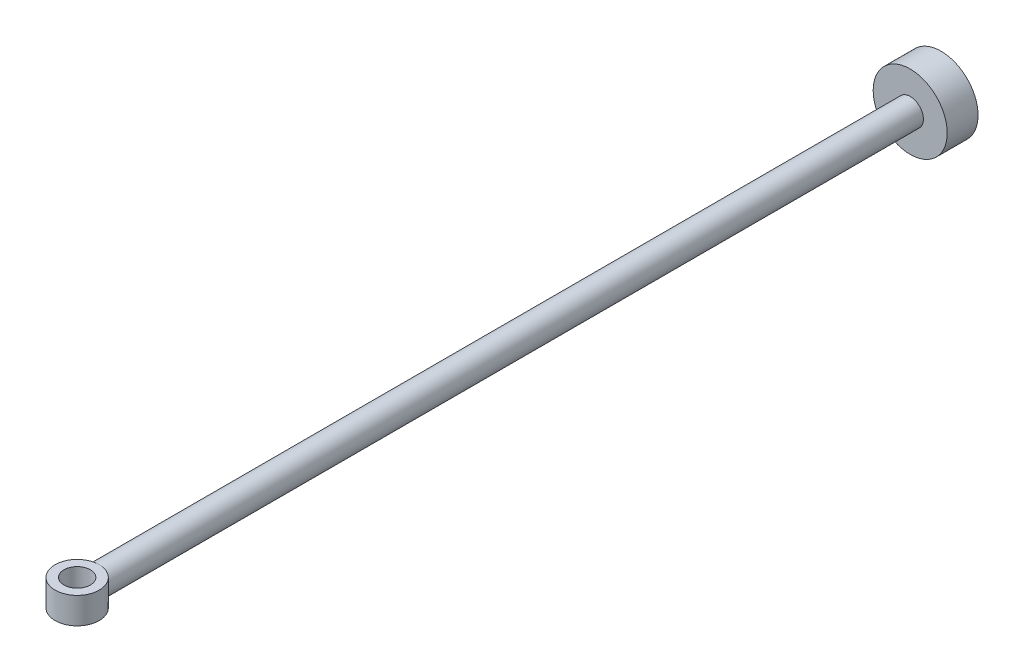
ISO-10303-21;
HEADER;
FILE_DESCRIPTION(('STEP AP214'),'2;1');
FILE_NAME('part.step','',(''),(''),'','','');
FILE_SCHEMA(('AUTOMOTIVE_DESIGN { 1 0 10303 214 1 1 1 1 }'));
ENDSEC;
DATA;
#1=APPLICATION_CONTEXT('core data for automotive mechanical design processes');
#2=APPLICATION_PROTOCOL_DEFINITION('international standard','automotive_design',2000,#1);
#3=PRODUCT_CONTEXT('',#1,'mechanical');
#4=PRODUCT('Part','Part','',(#3));
#5=PRODUCT_RELATED_PRODUCT_CATEGORY('part','',(#4));
#6=PRODUCT_DEFINITION_FORMATION('','',#4);
#7=PRODUCT_DEFINITION_CONTEXT('part definition',#1,'design');
#8=PRODUCT_DEFINITION('design','',#6,#7);
#9=PRODUCT_DEFINITION_SHAPE('','',#8);
#10=(LENGTH_UNIT() NAMED_UNIT(*) SI_UNIT(.MILLI.,.METRE.));
#11=(NAMED_UNIT(*) PLANE_ANGLE_UNIT() SI_UNIT($,.RADIAN.));
#12=(NAMED_UNIT(*) SI_UNIT($,.STERADIAN.) SOLID_ANGLE_UNIT());
#13=UNCERTAINTY_MEASURE_WITH_UNIT(LENGTH_MEASURE(1.E-05),#10,'distance_accuracy_value','');
#14=(GEOMETRIC_REPRESENTATION_CONTEXT(3) GLOBAL_UNCERTAINTY_ASSIGNED_CONTEXT((#13)) GLOBAL_UNIT_ASSIGNED_CONTEXT((#10,
#11,#12)) REPRESENTATION_CONTEXT('',''));
#15=CARTESIAN_POINT('',(0.,0.,0.));
#16=DIRECTION('',(0.,0.,1.));
#17=DIRECTION('',(1.,0.,0.));
#18=AXIS2_PLACEMENT_3D('',#15,#16,#17);
#19=CARTESIAN_POINT('',(0.,0.,925.));
#20=DIRECTION('',(0.,0.,-1.));
#21=DIRECTION('',(-1.,0.,0.));
#22=AXIS2_PLACEMENT_3D('',#19,#20,#21);
#23=CYLINDRICAL_SURFACE('',#22,15.);
#24=CARTESIAN_POINT('',(0.,0.,0.));
#25=DIRECTION('',(0.,0.,-1.));
#26=DIRECTION('',(-1.,0.,0.));
#27=AXIS2_PLACEMENT_3D('',#24,#25,#26);
#28=CIRCLE('',#27,15.);
#29=CARTESIAN_POINT('',(-15.,0.,0.));
#30=VERTEX_POINT('',#29);
#31=EDGE_CURVE('E11',#30,#30,#28,.T.);
#32=ORIENTED_EDGE('',*,*,#31,.F.);
#33=EDGE_LOOP('',(#32));
#34=FACE_BOUND('',#33,.T.);
#35=CARTESIAN_POINT('',(0.,-15.,920.));
#36=CARTESIAN_POINT('',(0.192860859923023,-15.0000014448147,919.999997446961));
#37=CARTESIAN_POINT('',(0.385694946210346,-14.9962796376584,920.002232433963));
#38=CARTESIAN_POINT('',(0.770964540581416,-14.9814143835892,920.011147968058));
#39=CARTESIAN_POINT('',(0.963400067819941,-14.9702713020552,920.017828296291));
#40=CARTESIAN_POINT('',(1.53933864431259,-14.9257686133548,920.044480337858));
#41=CARTESIAN_POINT('',(1.92175698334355,-14.8813354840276,920.071063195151));
#42=CARTESIAN_POINT('',(2.6783661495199,-14.7638811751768,920.140997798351));
#43=CARTESIAN_POINT('',(3.05259072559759,-14.6910190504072,920.184256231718));
#44=CARTESIAN_POINT('',(3.79241058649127,-14.5176433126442,920.28650031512));
#45=CARTESIAN_POINT('',(4.15800515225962,-14.4171274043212,920.345487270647));
#46=CARTESIAN_POINT('',(4.87752729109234,-14.1898499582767,920.477697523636));
#47=CARTESIAN_POINT('',(5.23147447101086,-14.0631354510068,920.550895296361));
#48=CARTESIAN_POINT('',(5.9264462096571,-13.7846796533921,920.70999508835));
#49=CARTESIAN_POINT('',(6.26746941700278,-13.6329357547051,920.795898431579));
#50=CARTESIAN_POINT('',(6.93525859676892,-13.3056605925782,920.978714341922));
#51=CARTESIAN_POINT('',(7.26200977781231,-13.130105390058,921.075637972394));
#52=CARTESIAN_POINT('',(7.89956440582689,-12.7566995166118,921.278515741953));
#53=CARTESIAN_POINT('',(8.21036714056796,-12.5588478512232,921.384470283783));
#54=CARTESIAN_POINT('',(8.83778736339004,-12.1263946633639,921.61168926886));
#55=CARTESIAN_POINT('',(9.15306964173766,-11.8901459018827,921.733505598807));
#56=CARTESIAN_POINT('',(9.76291888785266,-11.3947285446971,921.982745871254));
#57=CARTESIAN_POINT('',(10.0574771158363,-11.1355503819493,922.110172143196));
#58=CARTESIAN_POINT('',(10.6250045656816,-10.5954171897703,922.368020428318));
#59=CARTESIAN_POINT('',(10.8979553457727,-10.3144439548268,922.498444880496));
#60=CARTESIAN_POINT('',(11.4210525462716,-9.73204917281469,922.759383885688));
#61=CARTESIAN_POINT('',(11.671198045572,-9.4306268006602,922.889898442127));
#62=CARTESIAN_POINT('',(12.176992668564,-8.7700907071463,923.16394242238));
#63=CARTESIAN_POINT('',(12.4295410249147,-8.40843919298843,923.307100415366));
#64=CARTESIAN_POINT('',(12.9030768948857,-7.66198299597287,923.585377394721));
#65=CARTESIAN_POINT('',(13.1240591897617,-7.27717449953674,923.720495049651));
#66=CARTESIAN_POINT('',(13.5322686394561,-6.48655272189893,923.977729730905));
#67=CARTESIAN_POINT('',(13.719540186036,-6.08076798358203,924.099863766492));
#68=CARTESIAN_POINT('',(14.0584569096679,-5.24984883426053,924.326311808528));
#69=CARTESIAN_POINT('',(14.2101153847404,-4.82472171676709,924.430632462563));
#70=CARTESIAN_POINT('',(14.443429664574,-4.06270218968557,924.594059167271));
#71=CARTESIAN_POINT('',(14.5331460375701,-3.72929594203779,924.65800030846));
#72=CARTESIAN_POINT('',(14.6897491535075,-3.05468494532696,924.770798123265));
#73=CARTESIAN_POINT('',(14.7566409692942,-2.71348194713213,924.819658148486));
#74=CARTESIAN_POINT('',(14.8666727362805,-2.0256408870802,924.900579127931));
#75=CARTESIAN_POINT('',(14.9098367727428,-1.67900870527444,924.932657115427));
#76=CARTESIAN_POINT('',(14.9718813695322,-0.982367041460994,924.978904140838));
#77=CARTESIAN_POINT('',(14.9907615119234,-0.632357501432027,924.993072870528));
#78=CARTESIAN_POINT('',(15.00394994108,0.069076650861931,925.002961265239));
#79=CARTESIAN_POINT('',(14.9982098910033,0.420502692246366,924.998644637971));
#80=CARTESIAN_POINT('',(14.9621409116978,1.12137271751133,924.97164914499));
#81=CARTESIAN_POINT('',(14.9318118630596,1.47081669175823,924.948970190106));
#82=CARTESIAN_POINT('',(14.8470080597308,2.16537418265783,924.886096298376));
#83=CARTESIAN_POINT('',(14.7925178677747,2.51048478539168,924.845890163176));
#84=CARTESIAN_POINT('',(14.6601586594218,3.19388594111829,924.749409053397));
#85=CARTESIAN_POINT('',(14.5822891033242,3.53217633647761,924.693133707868));
#86=CARTESIAN_POINT('',(14.4053151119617,4.19561909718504,924.567219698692));
#87=CARTESIAN_POINT('',(14.3065055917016,4.52088612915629,924.49776790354));
#88=CARTESIAN_POINT('',(14.0880230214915,5.16161070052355,924.347028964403));
#89=CARTESIAN_POINT('',(13.9683431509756,5.4770649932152,924.265737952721));
#90=CARTESIAN_POINT('',(13.7091201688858,6.096958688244,924.093440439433));
#91=CARTESIAN_POINT('',(13.5695760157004,6.40139751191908,924.002433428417));
#92=CARTESIAN_POINT('',(13.2715462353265,6.99838443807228,923.812804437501));
#93=CARTESIAN_POINT('',(13.1130596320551,7.29093192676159,923.714182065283));
#94=CARTESIAN_POINT('',(12.7486309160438,7.91355198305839,923.49359749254));
#95=CARTESIAN_POINT('',(12.5392377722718,8.24123192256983,923.370571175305));
#96=CARTESIAN_POINT('',(12.0966533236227,8.87813926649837,923.119971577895));
#97=CARTESIAN_POINT('',(11.8634657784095,9.18736957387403,922.992399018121));
#98=CARTESIAN_POINT('',(11.3740114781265,9.78681422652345,922.735491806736));
#99=CARTESIAN_POINT('',(11.1177207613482,10.0770082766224,922.606155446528));
#100=CARTESIAN_POINT('',(10.5831976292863,10.6370000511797,922.348643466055));
#101=CARTESIAN_POINT('',(10.3049641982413,10.9067968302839,922.220467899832));
#102=CARTESIAN_POINT('',(9.68709201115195,11.4610510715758,921.950287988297));
#103=CARTESIAN_POINT('',(9.34430498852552,11.7422911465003,921.808853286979));
#104=CARTESIAN_POINT('',(8.63283493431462,12.2748369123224,921.534716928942));
#105=CARTESIAN_POINT('',(8.264148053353,12.5261381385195,921.40201657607));
#106=CARTESIAN_POINT('',(7.50293001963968,12.9963862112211,921.149071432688));
#107=CARTESIAN_POINT('',(7.11041316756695,13.215352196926,921.028819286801));
#108=CARTESIAN_POINT('',(6.30369026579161,13.6186156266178,920.804160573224));
#109=CARTESIAN_POINT('',(5.88949084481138,13.8029235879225,920.699749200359));
#110=CARTESIAN_POINT('',(5.12444851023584,14.1022888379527,920.52833091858));
#111=CARTESIAN_POINT('',(4.77687988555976,14.2238446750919,920.457996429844));
#112=CARTESIAN_POINT('',(4.07144379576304,14.4415904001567,920.331159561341));
#113=CARTESIAN_POINT('',(3.71357812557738,14.5377846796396,920.274654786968));
#114=CARTESIAN_POINT('',(2.99046346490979,14.7035529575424,920.176825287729));
#115=CARTESIAN_POINT('',(2.62523067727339,14.7731798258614,920.135470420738));
#116=CARTESIAN_POINT('',(1.88930637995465,14.8851909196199,920.068757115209));
#117=CARTESIAN_POINT('',(1.51861794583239,14.9275899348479,920.043389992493));
#118=CARTESIAN_POINT('',(0.955880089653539,14.9707353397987,920.017550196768));
#119=CARTESIAN_POINT('',(0.764828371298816,14.9817109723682,920.010970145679));
#120=CARTESIAN_POINT('',(0.382525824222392,14.9963406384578,920.002195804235));
#121=CARTESIAN_POINT('',(0.191275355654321,15.0000015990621,919.999997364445));
#122=CARTESIAN_POINT('',(0.,15.,920.));
#123=B_SPLINE_CURVE_WITH_KNOTS('',3,(#35,#36,#37,#38,#39,#40,#41,#42,#43,#44,#45,#46,#47,#48,
#49,#50,#51,#52,#53,#54,#55,#56,#57,#58,#59,#60,#61,#62,#63,#64,#65,#66,#67,#68,#69,#70,#71,#72,
#73,#74,#75,#76,#77,#78,#79,#80,#81,#82,#83,#84,#85,#86,#87,#88,#89,#90,#91,#92,#93,#94,#95,#96,
#97,#98,#99,#100,#101,#102,#103,#104,#105,#106,#107,#108,#109,#110,#111,#112,#113,#114,#115,
#116,#117,#118,#119,#120,#121,#122),.UNSPECIFIED.,.F.,.F.,(4,2,2,2,2,2,2,2,2,2,2,2,2,2,2,2,2,2,
2,2,2,2,2,2,2,2,2,2,2,2,2,2,2,2,2,2,2,2,2,2,2,2,2,4),(0.,0.578480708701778,1.15693293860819,
2.31299060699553,3.46267101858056,4.61244688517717,5.76017637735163,6.90802555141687,
8.057037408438,9.20610053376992,10.4419897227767,11.6783970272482,12.9158484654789,
14.1533498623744,15.5429150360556,16.9327096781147,18.3206605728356,19.7080923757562,
20.7604537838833,21.8125811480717,22.8636385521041,23.9147140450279,24.9678540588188,
26.0209991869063,27.0748181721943,28.1286614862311,29.1685467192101,30.2087724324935,
31.2490527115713,32.2893866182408,33.5117829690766,34.733986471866,35.9574725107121,
37.1810152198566,38.5754889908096,39.9701704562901,41.364023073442,42.7574520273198,
43.8808904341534,45.004134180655,46.1251308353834,47.2455180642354,47.8197913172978,
48.3935204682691),.UNSPECIFIED.);
#124=CARTESIAN_POINT('',(0.,-15.,920.));
#125=VERTEX_POINT('',#124);
#126=CARTESIAN_POINT('',(0.,15.,920.));
#127=VERTEX_POINT('',#126);
#128=EDGE_CURVE('E49',#125,#127,#123,.T.);
#129=ORIENTED_EDGE('',*,*,#128,.F.);
#130=CARTESIAN_POINT('',(0.,15.,920.));
#131=CARTESIAN_POINT('',(-0.192860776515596,15.0000014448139,919.999997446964));
#132=CARTESIAN_POINT('',(-0.385694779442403,14.9962796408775,920.00223243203));
#133=CARTESIAN_POINT('',(-0.770964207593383,14.9814143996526,920.011147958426));
#134=CARTESIAN_POINT('',(-0.963399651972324,14.9702713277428,920.017828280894));
#135=CARTESIAN_POINT('',(-1.53933798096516,14.9257686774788,920.044480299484));
#136=CARTESIAN_POINT('',(-1.92175615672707,14.8813355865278,920.071063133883));
#137=CARTESIAN_POINT('',(-2.67836533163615,14.7638813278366,920.140997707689));
#138=CARTESIAN_POINT('',(-3.05259007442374,14.6910191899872,920.184256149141));
#139=CARTESIAN_POINT('',(-3.79241026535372,14.5176434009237,920.286500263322));
#140=CARTESIAN_POINT('',(-4.15800499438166,14.4171274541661,920.345487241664));
#141=CARTESIAN_POINT('',(-4.87752609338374,14.1898503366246,920.477697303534));
#142=CARTESIAN_POINT('',(-5.23147211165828,14.0631362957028,920.550894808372));
#143=CARTESIAN_POINT('',(-5.92644161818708,13.7846815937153,920.709993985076));
#144=CARTESIAN_POINT('',(-6.26746375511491,13.632938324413,920.795896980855));
#145=CARTESIAN_POINT('',(-6.93525309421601,13.3056634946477,920.978712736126));
#146=CARTESIAN_POINT('',(-7.262005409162,13.1301078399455,921.075636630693));
#147=CARTESIAN_POINT('',(-7.89956227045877,12.7567008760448,921.278515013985));
#148=CARTESIAN_POINT('',(-8.21036610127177,12.5588485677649,921.384469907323));
#149=CARTESIAN_POINT('',(-8.83779425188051,12.1263899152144,921.6116917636));
#150=CARTESIAN_POINT('',(-9.15308300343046,11.8901358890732,921.733510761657));
#151=CARTESIAN_POINT('',(-9.76294440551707,11.3947069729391,921.982756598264));
#152=CARTESIAN_POINT('',(-10.0575083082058,11.1355225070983,922.11018576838));
#153=CARTESIAN_POINT('',(-10.6250339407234,10.5953874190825,922.368034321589));
#154=CARTESIAN_POINT('',(-10.8979781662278,10.3144195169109,922.498456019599));
#155=CARTESIAN_POINT('',(-11.421063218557,9.7320363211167,922.759389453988));
#156=CARTESIAN_POINT('',(-11.671203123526,9.43062020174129,922.889901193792));
#157=CARTESIAN_POINT('',(-12.1769603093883,8.7701329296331,923.163924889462));
#158=CARTESIAN_POINT('',(-12.4294799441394,8.40852651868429,923.30706578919));
#159=CARTESIAN_POINT('',(-12.9029623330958,7.66217254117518,923.585308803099));
#160=CARTESIAN_POINT('',(-13.1239203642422,7.2774215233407,923.720409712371));
#161=CARTESIAN_POINT('',(-13.5321392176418,6.48682519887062,923.977646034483));
#162=CARTESIAN_POINT('',(-13.7194366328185,6.08100342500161,924.099795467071));
#163=CARTESIAN_POINT('',(-14.0584072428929,5.24998901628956,924.326277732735));
#164=CARTESIAN_POINT('',(-14.2100914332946,4.82480240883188,924.430616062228));
#165=CARTESIAN_POINT('',(-14.4501766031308,4.04066425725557,924.598784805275));
#166=CARTESIAN_POINT('',(-14.5451300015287,3.68455366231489,924.666545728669));
#167=CARTESIAN_POINT('',(-14.7089736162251,2.96356047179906,924.784749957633));
#168=CARTESIAN_POINT('',(-14.7778675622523,2.59867913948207,924.835195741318));
#169=CARTESIAN_POINT('',(-14.8884829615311,1.86311947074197,924.916727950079));
#170=CARTESIAN_POINT('',(-14.9302375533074,1.49244877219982,924.947837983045));
#171=CARTESIAN_POINT('',(-14.9859963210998,0.74785271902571,924.989474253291));
#172=CARTESIAN_POINT('',(-15.0000001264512,0.373927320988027,925.000000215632));
#173=CARTESIAN_POINT('',(-14.9999998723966,-0.377334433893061,924.999999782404));
#174=CARTESIAN_POINT('',(-14.9857394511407,-0.754670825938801,924.989280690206));
#175=CARTESIAN_POINT('',(-14.9289611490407,-1.50601225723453,924.946886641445));
#176=CARTESIAN_POINT('',(-14.8864426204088,-1.88001721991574,924.91521120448));
#177=CARTESIAN_POINT('',(-14.7738334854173,-2.62198472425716,924.832235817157));
#178=CARTESIAN_POINT('',(-14.7037160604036,-2.98994102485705,924.780916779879));
#179=CARTESIAN_POINT('',(-14.5369932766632,-3.71684042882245,924.660718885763));
#180=CARTESIAN_POINT('',(-14.4403870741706,-4.07578324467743,924.591839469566));
#181=CARTESIAN_POINT('',(-14.2227797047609,-4.77988599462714,924.43960097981));
#182=CARTESIAN_POINT('',(-14.1019690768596,-5.12512980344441,924.356355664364));
#183=CARTESIAN_POINT('',(-13.8367175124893,-5.80326402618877,924.177636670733));
#184=CARTESIAN_POINT('',(-13.6922676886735,-6.13614973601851,924.082158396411));
#185=CARTESIAN_POINT('',(-13.3809615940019,-6.7882557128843,923.881663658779));
#186=CARTESIAN_POINT('',(-13.2141053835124,-7.107476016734,923.776647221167));
#187=CARTESIAN_POINT('',(-12.8590560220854,-7.73133304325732,923.559665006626));
#188=CARTESIAN_POINT('',(-12.6708621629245,-8.03596928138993,923.447698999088));
#189=CARTESIAN_POINT('',(-12.2497723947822,-8.66624267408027,923.205297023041));
#190=CARTESIAN_POINT('',(-12.0142244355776,-8.98988614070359,923.07427781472));
#191=CARTESIAN_POINT('',(-11.5186392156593,-9.616680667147,922.809916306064));
#192=CARTESIAN_POINT('',(-11.2586071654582,-9.91983606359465,922.676574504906));
#193=CARTESIAN_POINT('',(-10.7147783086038,-10.504911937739,922.410506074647));
#194=CARTESIAN_POINT('',(-10.4309597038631,-10.7868124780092,922.277780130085));
#195=CARTESIAN_POINT('',(-9.84076660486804,-11.3278232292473,922.016015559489));
#196=CARTESIAN_POINT('',(-9.53439110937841,-11.5869324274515,921.886977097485));
#197=CARTESIAN_POINT('',(-8.86558476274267,-12.107851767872,921.621709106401));
#198=CARTESIAN_POINT('',(-8.5006828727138,-12.3668831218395,921.486226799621));
#199=CARTESIAN_POINT('',(-7.74613530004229,-12.8529681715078,921.226979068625));
#200=CARTESIAN_POINT('',(-7.35648671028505,-13.0800181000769,921.10321502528));
#201=CARTESIAN_POINT('',(-6.55546683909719,-13.4992510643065,920.871192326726));
#202=CARTESIAN_POINT('',(-6.14414009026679,-13.6915022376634,920.762903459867));
#203=CARTESIAN_POINT('',(-5.30193153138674,-14.0391206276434,920.564851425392));
#204=CARTESIAN_POINT('',(-4.87105486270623,-14.1944974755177,920.475083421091));
#205=CARTESIAN_POINT('',(-4.07829184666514,-14.4396965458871,920.332268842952));
#206=CARTESIAN_POINT('',(-3.71918952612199,-14.5363859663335,920.275477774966));
#207=CARTESIAN_POINT('',(-2.99287256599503,-14.7031116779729,920.177088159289));
#208=CARTESIAN_POINT('',(-2.62565989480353,-14.7731543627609,920.13548596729));
#209=CARTESIAN_POINT('',(-1.88360670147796,-14.8860182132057,920.068263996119));
#210=CARTESIAN_POINT('',(-1.50873656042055,-14.928696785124,920.04272794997));
#211=CARTESIAN_POINT('',(-0.944227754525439,-14.9714438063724,920.017125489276));
#212=CARTESIAN_POINT('',(-0.755610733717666,-14.9821476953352,920.010708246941));
#213=CARTESIAN_POINT('',(-0.378004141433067,-14.9964266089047,920.002144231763));
#214=CARTESIAN_POINT('',(-0.189014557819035,-15.000001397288,919.999997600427));
#215=CARTESIAN_POINT('',(0.,-15.,920.));
#216=B_SPLINE_CURVE_WITH_KNOTS('',3,(#130,#131,#132,#133,#134,#135,#136,#137,#138,#139,#140,
#141,#142,#143,#144,#145,#146,#147,#148,#149,#150,#151,#152,#153,#154,#155,#156,#157,#158,#159,
#160,#161,#162,#163,#164,#165,#166,#167,#168,#169,#170,#171,#172,#173,#174,#175,#176,#177,#178,
#179,#180,#181,#182,#183,#184,#185,#186,#187,#188,#189,#190,#191,#192,#193,#194,#195,#196,#197,
#198,#199,#200,#201,#202,#203,#204,#205,#206,#207,#208,#209,#210,#211,#212,#213,#214,#215),
.UNSPECIFIED.,.F.,.F.,(4,2,2,2,2,2,2,2,2,2,2,2,2,2,2,2,2,2,2,2,2,2,2,2,2,2,2,2,2,2,2,2,2,2,2,2,
2,2,2,2,2,2,4),(0.,0.578480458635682,1.15693243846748,2.31298960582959,3.46267051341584,
4.61244688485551,5.76017255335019,6.90801789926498,8.05703346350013,9.20610053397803,
10.4420159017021,11.6784498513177,12.9158748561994,14.1533498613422,15.5427469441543,
16.932351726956,18.3204365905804,19.7080923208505,20.8309857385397,21.9537183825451,
23.0750775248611,24.1964516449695,25.3280433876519,26.4596610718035,27.5923811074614,
28.7251372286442,29.8493037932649,30.9738939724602,32.0984811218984,33.2231056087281,
34.485388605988,35.7474035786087,37.0105879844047,38.2738284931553,39.6746380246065,
41.0756124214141,42.4738132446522,43.8716484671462,44.998993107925,46.1260670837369,
47.2589674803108,47.8258969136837,48.3928451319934),.UNSPECIFIED.);
#217=EDGE_CURVE('E46',#127,#125,#216,.T.);
#218=ORIENTED_EDGE('',*,*,#217,.F.);
#219=EDGE_LOOP('',(#129,#218));
#220=FACE_BOUND('',#219,.T.);
#221=ADVANCED_FACE('F30',(#34,#220),#23,.T.);
#222=CARTESIAN_POINT('',(0.,0.,0.));
#223=DIRECTION('',(0.,0.,-1.));
#224=DIRECTION('',(-1.,0.,0.));
#225=AXIS2_PLACEMENT_3D('',#222,#223,#224);
#226=PLANE('',#225);
#227=CARTESIAN_POINT('',(0.,0.,0.));
#228=DIRECTION('',(0.,0.,-1.));
#229=DIRECTION('',(-1.,0.,0.));
#230=AXIS2_PLACEMENT_3D('',#227,#228,#229);
#231=CIRCLE('',#230,42.);
#232=CARTESIAN_POINT('',(-42.,0.,0.));
#233=VERTEX_POINT('',#232);
#234=EDGE_CURVE('E57',#233,#233,#231,.T.);
#235=ORIENTED_EDGE('',*,*,#234,.F.);
#236=EDGE_LOOP('',(#235));
#237=FACE_BOUND('',#236,.T.);
#238=ORIENTED_EDGE('',*,*,#31,.T.);
#239=EDGE_LOOP('',(#238));
#240=FACE_BOUND('',#239,.T.);
#241=ADVANCED_FACE('F85',(#237,#240),#226,.F.);
#242=CARTESIAN_POINT('',(0.,0.,-35.));
#243=DIRECTION('',(0.,0.,1.));
#244=DIRECTION('',(1.,0.,0.));
#245=AXIS2_PLACEMENT_3D('',#242,#243,#244);
#246=CYLINDRICAL_SURFACE('',#245,42.);
#247=CARTESIAN_POINT('',(0.,0.,-35.));
#248=DIRECTION('',(0.,0.,-1.));
#249=DIRECTION('',(-1.,0.,0.));
#250=AXIS2_PLACEMENT_3D('',#247,#248,#249);
#251=CIRCLE('',#250,42.);
#252=CARTESIAN_POINT('',(-42.,0.,-35.));
#253=VERTEX_POINT('',#252);
#254=EDGE_CURVE('E39',#253,#253,#251,.T.);
#255=ORIENTED_EDGE('',*,*,#254,.F.);
#256=EDGE_LOOP('',(#255));
#257=FACE_BOUND('',#256,.T.);
#258=ORIENTED_EDGE('',*,*,#234,.T.);
#259=EDGE_LOOP('',(#258));
#260=FACE_BOUND('',#259,.T.);
#261=ADVANCED_FACE('F83',(#257,#260),#246,.T.);
#262=CARTESIAN_POINT('',(0.,0.,-35.));
#263=DIRECTION('',(0.,0.,-1.));
#264=DIRECTION('',(-1.,0.,0.));
#265=AXIS2_PLACEMENT_3D('',#262,#263,#264);
#266=PLANE('',#265);
#267=ORIENTED_EDGE('',*,*,#254,.T.);
#268=EDGE_LOOP('',(#267));
#269=FACE_BOUND('',#268,.T.);
#270=ADVANCED_FACE('F77',(#269),#266,.T.);
#271=CARTESIAN_POINT('',(0.,15.,945.));
#272=DIRECTION('',(0.,-1.,0.));
#273=DIRECTION('',(0.,0.,-1.));
#274=AXIS2_PLACEMENT_3D('',#271,#272,#273);
#275=CYLINDRICAL_SURFACE('',#274,25.);
#276=ORIENTED_EDGE('',*,*,#217,.T.);
#277=CARTESIAN_POINT('',(0.,-15.,945.));
#278=DIRECTION('',(0.,1.,0.));
#279=DIRECTION('',(0.,0.,1.));
#280=AXIS2_PLACEMENT_3D('',#277,#278,#279);
#281=CIRCLE('',#280,25.);
#282=EDGE_CURVE('E54',#125,#125,#281,.T.);
#283=ORIENTED_EDGE('',*,*,#282,.T.);
#284=ORIENTED_EDGE('',*,*,#128,.T.);
#285=CARTESIAN_POINT('',(0.,15.,945.));
#286=DIRECTION('',(0.,1.,0.));
#287=DIRECTION('',(0.,0.,1.));
#288=AXIS2_PLACEMENT_3D('',#285,#286,#287);
#289=CIRCLE('',#288,25.);
#290=EDGE_CURVE('E52',#127,#127,#289,.T.);
#291=ORIENTED_EDGE('',*,*,#290,.F.);
#292=EDGE_LOOP('',(#276,#283,#284,#291));
#293=FACE_BOUND('',#292,.T.);
#294=ADVANCED_FACE('F50',(#293),#275,.T.);
#295=CARTESIAN_POINT('',(0.,15.,945.));
#296=DIRECTION('',(0.,1.,0.));
#297=DIRECTION('',(0.,0.,1.));
#298=AXIS2_PLACEMENT_3D('',#295,#296,#297);
#299=PLANE('',#298);
#300=CARTESIAN_POINT('',(0.,15.,945.));
#301=DIRECTION('',(0.,1.,0.));
#302=DIRECTION('',(0.,0.,1.));
#303=AXIS2_PLACEMENT_3D('',#300,#301,#302);
#304=CIRCLE('',#303,15.);
#305=CARTESIAN_POINT('',(0.,15.,930.));
#306=VERTEX_POINT('',#305);
#307=EDGE_CURVE('E62',#306,#306,#304,.T.);
#308=ORIENTED_EDGE('',*,*,#307,.F.);
#309=EDGE_LOOP('',(#308));
#310=FACE_BOUND('',#309,.T.);
#311=ORIENTED_EDGE('',*,*,#290,.T.);
#312=EDGE_LOOP('',(#311));
#313=FACE_BOUND('',#312,.T.);
#314=ADVANCED_FACE('F60',(#310,#313),#299,.T.);
#315=CARTESIAN_POINT('',(0.,-15.,945.));
#316=DIRECTION('',(0.,1.,0.));
#317=DIRECTION('',(0.,0.,1.));
#318=AXIS2_PLACEMENT_3D('',#315,#316,#317);
#319=PLANE('',#318);
#320=CARTESIAN_POINT('',(0.,-15.,945.));
#321=DIRECTION('',(0.,1.,0.));
#322=DIRECTION('',(0.,0.,1.));
#323=AXIS2_PLACEMENT_3D('',#320,#321,#322);
#324=CIRCLE('',#323,15.);
#325=CARTESIAN_POINT('',(0.,-15.,930.));
#326=VERTEX_POINT('',#325);
#327=EDGE_CURVE('E34',#326,#326,#324,.T.);
#328=ORIENTED_EDGE('',*,*,#327,.T.);
#329=EDGE_LOOP('',(#328));
#330=FACE_BOUND('',#329,.T.);
#331=ORIENTED_EDGE('',*,*,#282,.F.);
#332=EDGE_LOOP('',(#331));
#333=FACE_BOUND('',#332,.T.);
#334=ADVANCED_FACE('F78',(#330,#333),#319,.F.);
#335=CARTESIAN_POINT('',(0.,45.,945.));
#336=DIRECTION('',(0.,-1.,0.));
#337=DIRECTION('',(0.,0.,-1.));
#338=AXIS2_PLACEMENT_3D('',#335,#336,#337);
#339=CYLINDRICAL_SURFACE('',#338,15.);
#340=CARTESIAN_POINT('',(0.,15.,930.));
#341=CARTESIAN_POINT('',(0.,14.6875,930.));
#342=CARTESIAN_POINT('',(0.,14.375,930.));
#343=CARTESIAN_POINT('',(0.,13.75,930.));
#344=CARTESIAN_POINT('',(0.,13.4375,930.));
#345=CARTESIAN_POINT('',(0.,12.8125,930.));
#346=CARTESIAN_POINT('',(0.,12.5,930.));
#347=CARTESIAN_POINT('',(0.,11.875,930.));
#348=CARTESIAN_POINT('',(0.,11.5625,930.));
#349=CARTESIAN_POINT('',(0.,10.9375,930.));
#350=CARTESIAN_POINT('',(0.,10.625,930.));
#351=CARTESIAN_POINT('',(0.,10.,930.));
#352=CARTESIAN_POINT('',(0.,9.6875,930.));
#353=CARTESIAN_POINT('',(0.,9.0625,930.));
#354=CARTESIAN_POINT('',(0.,8.75,930.));
#355=CARTESIAN_POINT('',(0.,8.125,930.));
#356=CARTESIAN_POINT('',(0.,7.8125,930.));
#357=CARTESIAN_POINT('',(0.,7.1875,930.));
#358=CARTESIAN_POINT('',(0.,6.875,930.));
#359=CARTESIAN_POINT('',(0.,6.25,930.));
#360=CARTESIAN_POINT('',(0.,5.9375,930.));
#361=CARTESIAN_POINT('',(0.,5.3125,930.));
#362=CARTESIAN_POINT('',(0.,5.,930.));
#363=CARTESIAN_POINT('',(0.,4.375,930.));
#364=CARTESIAN_POINT('',(0.,4.0625,930.));
#365=CARTESIAN_POINT('',(0.,3.4375,930.));
#366=CARTESIAN_POINT('',(0.,3.125,930.));
#367=CARTESIAN_POINT('',(0.,2.5,930.));
#368=CARTESIAN_POINT('',(0.,2.1875,930.));
#369=CARTESIAN_POINT('',(0.,1.5625,930.));
#370=CARTESIAN_POINT('',(0.,1.25,930.));
#371=CARTESIAN_POINT('',(0.,0.624999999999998,930.));
#372=CARTESIAN_POINT('',(0.,0.312499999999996,930.));
#373=CARTESIAN_POINT('',(0.,-0.312500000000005,930.));
#374=CARTESIAN_POINT('',(0.,-0.625000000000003,930.));
#375=CARTESIAN_POINT('',(0.,-1.25,930.));
#376=CARTESIAN_POINT('',(0.,-1.56250000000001,930.));
#377=CARTESIAN_POINT('',(0.,-2.18750000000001,930.));
#378=CARTESIAN_POINT('',(0.,-2.5,930.));
#379=CARTESIAN_POINT('',(0.,-3.125,930.));
#380=CARTESIAN_POINT('',(0.,-3.4375,930.));
#381=CARTESIAN_POINT('',(0.,-4.0625,930.));
#382=CARTESIAN_POINT('',(0.,-4.375,930.));
#383=CARTESIAN_POINT('',(0.,-5.,930.));
#384=CARTESIAN_POINT('',(0.,-5.3125,930.));
#385=CARTESIAN_POINT('',(0.,-5.93750000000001,930.));
#386=CARTESIAN_POINT('',(0.,-6.25000000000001,930.));
#387=CARTESIAN_POINT('',(0.,-6.87500000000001,930.));
#388=CARTESIAN_POINT('',(0.,-7.18750000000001,930.));
#389=CARTESIAN_POINT('',(0.,-7.81250000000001,930.));
#390=CARTESIAN_POINT('',(0.,-8.12500000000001,930.));
#391=CARTESIAN_POINT('',(0.,-8.75000000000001,930.));
#392=CARTESIAN_POINT('',(0.,-9.0625,930.));
#393=CARTESIAN_POINT('',(0.,-9.6875,930.));
#394=CARTESIAN_POINT('',(0.,-10.,930.));
#395=CARTESIAN_POINT('',(0.,-10.625,930.));
#396=CARTESIAN_POINT('',(0.,-10.9375,930.));
#397=CARTESIAN_POINT('',(0.,-11.5625,930.));
#398=CARTESIAN_POINT('',(0.,-11.875,930.));
#399=CARTESIAN_POINT('',(0.,-12.5,930.));
#400=CARTESIAN_POINT('',(0.,-12.8125,930.));
#401=CARTESIAN_POINT('',(0.,-13.4375,930.));
#402=CARTESIAN_POINT('',(0.,-13.75,930.));
#403=CARTESIAN_POINT('',(0.,-14.375,930.));
#404=CARTESIAN_POINT('',(0.,-14.6875,930.));
#405=CARTESIAN_POINT('',(0.,-15.,930.));
#406=B_SPLINE_CURVE_WITH_KNOTS('',3,(#340,#341,#342,#343,#344,#345,#346,#347,#348,#349,#350,
#351,#352,#353,#354,#355,#356,#357,#358,#359,#360,#361,#362,#363,#364,#365,#366,#367,#368,#369,
#370,#371,#372,#373,#374,#375,#376,#377,#378,#379,#380,#381,#382,#383,#384,#385,#386,#387,#388,
#389,#390,#391,#392,#393,#394,#395,#396,#397,#398,#399,#400,#401,#402,#403,#404,#405),
.UNSPECIFIED.,.F.,.F.,(4,2,2,2,2,2,2,2,2,2,2,2,2,2,2,2,2,2,2,2,2,2,2,2,2,2,2,2,2,2,2,2,4),(0.,
0.937500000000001,1.875,2.8125,3.75,4.6875,5.62499999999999,6.5625,7.5,8.4375,9.375,10.3125,
11.25,12.1875,13.125,14.0625,15.,15.9375,16.875,17.8125,18.75,19.6875,20.625,21.5625,22.5,
23.4375,24.375,25.3125,26.25,27.1875,28.125,29.0625,30.),.UNSPECIFIED.);
#407=EDGE_CURVE('BSEAM132',#306,#326,#406,.T.);
#408=ORIENTED_EDGE('',*,*,#307,.T.);
#409=ORIENTED_EDGE('',*,*,#327,.F.);
#410=ORIENTED_EDGE('',*,*,#407,.T.);
#411=ORIENTED_EDGE('',*,*,#407,.F.);
#412=EDGE_LOOP('',(#408,#410,#409,#411));
#413=FACE_BOUND('',#412,.T.);
#414=ADVANCED_FACE('F132',(#413),#339,.F.);
#415=CLOSED_SHELL('',(#221,#241,#261,#270,#294,#314,#334,#414));
#416=MANIFOLD_SOLID_BREP('B2',#415);
#417=ADVANCED_BREP_SHAPE_REPRESENTATION('',(#18,#416),#14);
#418=SHAPE_DEFINITION_REPRESENTATION(#9,#417);
ENDSEC;
END-ISO-10303-21;
